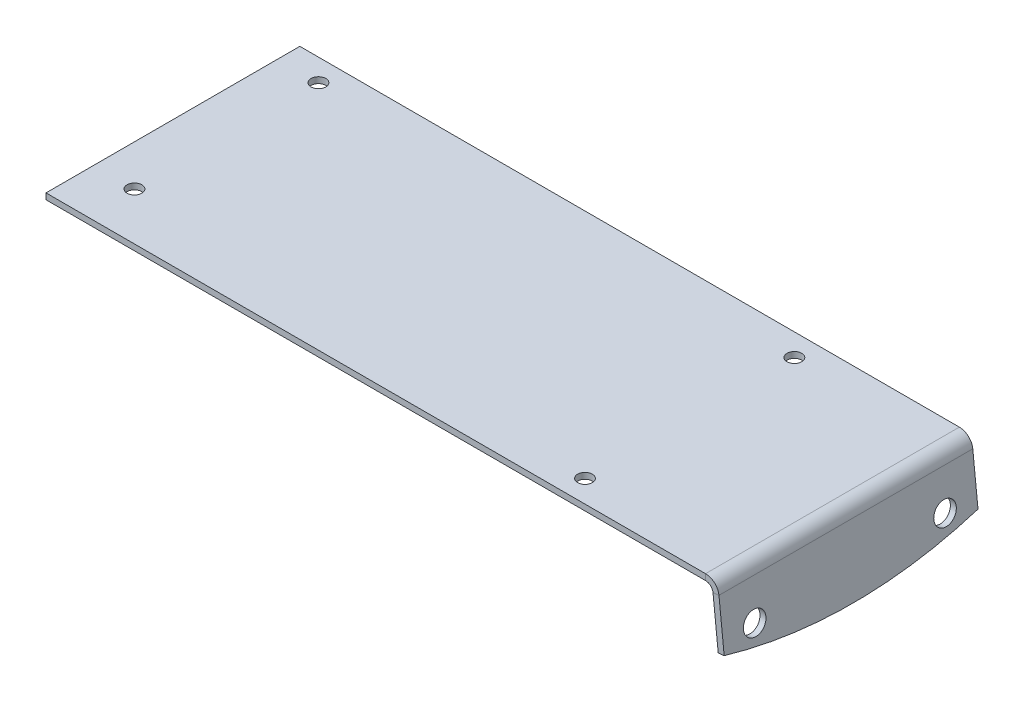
ISO-10303-21;
HEADER;
FILE_DESCRIPTION(('STEP AP214'),'2;1');
FILE_NAME('part.step','',(''),(''),'','','');
FILE_SCHEMA(('AUTOMOTIVE_DESIGN { 1 0 10303 214 1 1 1 1 }'));
ENDSEC;
DATA;
#1=APPLICATION_CONTEXT('core data for automotive mechanical design processes');
#2=APPLICATION_PROTOCOL_DEFINITION('international standard','automotive_design',2000,#1);
#3=PRODUCT_CONTEXT('',#1,'mechanical');
#4=PRODUCT('Part','Part','',(#3));
#5=PRODUCT_RELATED_PRODUCT_CATEGORY('part','',(#4));
#6=PRODUCT_DEFINITION_FORMATION('','',#4);
#7=PRODUCT_DEFINITION_CONTEXT('part definition',#1,'design');
#8=PRODUCT_DEFINITION('design','',#6,#7);
#9=PRODUCT_DEFINITION_SHAPE('','',#8);
#10=(LENGTH_UNIT() NAMED_UNIT(*) SI_UNIT(.MILLI.,.METRE.));
#11=(NAMED_UNIT(*) PLANE_ANGLE_UNIT() SI_UNIT($,.RADIAN.));
#12=(NAMED_UNIT(*) SI_UNIT($,.STERADIAN.) SOLID_ANGLE_UNIT());
#13=UNCERTAINTY_MEASURE_WITH_UNIT(LENGTH_MEASURE(1.E-05),#10,'distance_accuracy_value','');
#14=(GEOMETRIC_REPRESENTATION_CONTEXT(3) GLOBAL_UNCERTAINTY_ASSIGNED_CONTEXT((#13)) GLOBAL_UNIT_ASSIGNED_CONTEXT((#10,
#11,#12)) REPRESENTATION_CONTEXT('',''));
#15=CARTESIAN_POINT('',(0.,0.,0.));
#16=DIRECTION('',(0.,0.,1.));
#17=DIRECTION('',(1.,0.,0.));
#18=AXIS2_PLACEMENT_3D('',#15,#16,#17);
#19=CARTESIAN_POINT('',(136.517550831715,-18.657106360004,0.));
#20=DIRECTION('',(0.,0.,-1.));
#21=DIRECTION('',(-1.,0.,0.));
#22=AXIS2_PLACEMENT_3D('',#19,#20,#21);
#23=PLANE('',#22);
#24=DIRECTION('',(-0.994521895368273,-0.104528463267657,0.));
#25=VECTOR('',#24,1.);
#26=CARTESIAN_POINT('',(134.535130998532,-11.2757682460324,0.));
#27=LINE('',#26,#25);
#28=CARTESIAN_POINT('',(134.535130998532,-11.2757682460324,0.));
#29=VERTEX_POINT('',#28);
#30=CARTESIAN_POINT('',(135.728557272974,-11.1503340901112,0.));
#31=VERTEX_POINT('',#30);
#32=EDGE_CURVE('E50',#29,#31,#27,.F.);
#33=ORIENTED_EDGE('',*,*,#32,.T.);
#34=DIRECTION('',(0.104528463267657,-0.994521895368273,0.));
#35=VECTOR('',#34,1.);
#36=CARTESIAN_POINT('',(136.517550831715,-18.657106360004,0.));
#37=LINE('',#36,#35);
#38=CARTESIAN_POINT('',(134.684603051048,-1.21777314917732,0.));
#39=VERTEX_POINT('',#38);
#40=EDGE_CURVE('E116',#39,#31,#37,.T.);
#41=ORIENTED_EDGE('',*,*,#40,.F.);
#42=DIRECTION('',(0.994521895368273,0.104528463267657,0.));
#43=VECTOR('',#42,1.);
#44=CARTESIAN_POINT('',(133.491176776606,-1.34320730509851,0.));
#45=LINE('',#44,#43);
#46=CARTESIAN_POINT('',(133.491176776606,-1.34320730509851,0.));
#47=VERTEX_POINT('',#46);
#48=EDGE_CURVE('E208',#47,#39,#45,.T.);
#49=ORIENTED_EDGE('',*,*,#48,.F.);
#50=DIRECTION('',(0.104528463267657,-0.994521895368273,0.));
#51=VECTOR('',#50,1.);
#52=CARTESIAN_POINT('',(135.324124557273,-18.7825405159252,0.));
#53=LINE('',#52,#51);
#54=EDGE_CURVE('E130',#47,#29,#53,.T.);
#55=ORIENTED_EDGE('',*,*,#54,.T.);
#56=EDGE_LOOP('',(#33,#41,#49,#55));
#57=FACE_BOUND('',#56,.T.);
#58=ADVANCED_FACE('F33',(#57),#23,.F.);
#59=CARTESIAN_POINT('',(134.543426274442,0.12543415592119,-50.8));
#60=DIRECTION('',(0.,0.,1.));
#61=DIRECTION('',(1.,0.,0.));
#62=AXIS2_PLACEMENT_3D('',#59,#60,#61);
#63=PLANE('',#62);
#64=DIRECTION('',(-0.994521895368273,-0.104528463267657,0.));
#65=VECTOR('',#64,1.);
#66=CARTESIAN_POINT('',(134.535130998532,-11.2757682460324,-50.8));
#67=LINE('',#66,#65);
#68=CARTESIAN_POINT('',(134.535130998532,-11.2757682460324,-50.8));
#69=VERTEX_POINT('',#68);
#70=CARTESIAN_POINT('',(135.728557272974,-11.1503340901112,-50.8));
#71=VERTEX_POINT('',#70);
#72=EDGE_CURVE('E99',#69,#71,#67,.F.);
#73=ORIENTED_EDGE('',*,*,#72,.F.);
#74=DIRECTION('',(-0.104528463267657,0.994521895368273,0.));
#75=VECTOR('',#74,1.);
#76=CARTESIAN_POINT('',(133.35,0.,-50.8));
#77=LINE('',#76,#75);
#78=CARTESIAN_POINT('',(133.491176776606,-1.34320730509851,-50.8));
#79=VERTEX_POINT('',#78);
#80=EDGE_CURVE('E126',#69,#79,#77,.T.);
#81=ORIENTED_EDGE('',*,*,#80,.T.);
#82=DIRECTION('',(0.994521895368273,0.104528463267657,0.));
#83=VECTOR('',#82,1.);
#84=CARTESIAN_POINT('',(133.491176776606,-1.34320730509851,-50.8));
#85=LINE('',#84,#83);
#86=CARTESIAN_POINT('',(134.684603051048,-1.21777314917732,-50.8));
#87=VERTEX_POINT('',#86);
#88=EDGE_CURVE('E121',#79,#87,#85,.T.);
#89=ORIENTED_EDGE('',*,*,#88,.T.);
#90=DIRECTION('',(-0.104528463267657,0.994521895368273,0.));
#91=VECTOR('',#90,1.);
#92=CARTESIAN_POINT('',(134.543426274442,0.12543415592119,-50.8));
#93=LINE('',#92,#91);
#94=EDGE_CURVE('E113',#71,#87,#93,.T.);
#95=ORIENTED_EDGE('',*,*,#94,.F.);
#96=EDGE_LOOP('',(#73,#81,#89,#95));
#97=FACE_BOUND('',#96,.T.);
#98=ADVANCED_FACE('F119',(#97),#63,.F.);
#99=CARTESIAN_POINT('',(134.543426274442,0.12543415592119,0.));
#100=DIRECTION('',(-0.994521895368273,-0.104528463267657,0.));
#101=DIRECTION('',(0.104528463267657,-0.994521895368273,0.));
#102=AXIS2_PLACEMENT_3D('',#99,#100,#101);
#103=PLANE('',#102);
#104=CARTESIAN_POINT('',(135.481109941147,-8.79602999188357,-44.45));
#105=DIRECTION('',(0.994521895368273,0.104528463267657,0.));
#106=DIRECTION('',(-0.104528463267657,0.994521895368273,0.));
#107=AXIS2_PLACEMENT_3D('',#104,#105,#106);
#108=CIRCLE('',#107,2.2479);
#109=CARTESIAN_POINT('',(135.246140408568,-6.56044422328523,-44.45));
#110=VERTEX_POINT('',#109);
#111=EDGE_CURVE('E172',#110,#110,#108,.T.);
#112=ORIENTED_EDGE('',*,*,#111,.F.);
#113=EDGE_LOOP('',(#112));
#114=FACE_BOUND('',#113,.T.);
#115=CARTESIAN_POINT('',(135.481109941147,-8.79602999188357,-6.35));
#116=DIRECTION('',(0.994521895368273,0.104528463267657,0.));
#117=DIRECTION('',(-0.104528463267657,0.994521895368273,0.));
#118=AXIS2_PLACEMENT_3D('',#115,#116,#117);
#119=CIRCLE('',#118,2.2479);
#120=CARTESIAN_POINT('',(135.246140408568,-6.56044422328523,-6.35));
#121=VERTEX_POINT('',#120);
#122=EDGE_CURVE('E107',#121,#121,#119,.T.);
#123=ORIENTED_EDGE('',*,*,#122,.F.);
#124=EDGE_LOOP('',(#123));
#125=FACE_BOUND('',#124,.T.);
#126=CARTESIAN_POINT('',(126.132751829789,80.1476561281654,-25.4));
#127=DIRECTION('',(-0.994521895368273,-0.104528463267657,0.));
#128=DIRECTION('',(0.104528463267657,-0.994521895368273,0.));
#129=AXIS2_PLACEMENT_3D('',#126,#127,#128);
#130=CIRCLE('',#129,95.25);
#131=EDGE_CURVE('E102',#31,#71,#130,.F.);
#132=ORIENTED_EDGE('',*,*,#131,.T.);
#133=ORIENTED_EDGE('',*,*,#94,.T.);
#134=DIRECTION('',(0.,0.,-1.));
#135=VECTOR('',#134,1.);
#136=CARTESIAN_POINT('',(134.684603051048,-1.21777314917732,0.));
#137=LINE('',#136,#135);
#138=EDGE_CURVE('E133',#39,#87,#137,.T.);
#139=ORIENTED_EDGE('',*,*,#138,.F.);
#140=ORIENTED_EDGE('',*,*,#40,.T.);
#141=EDGE_LOOP('',(#132,#133,#139,#140));
#142=FACE_BOUND('',#141,.T.);
#143=ADVANCED_FACE('F111',(#114,#125,#142),#103,.F.);
#144=CARTESIAN_POINT('',(133.35,0.,0.));
#145=DIRECTION('',(-0.994521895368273,-0.104528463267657,0.));
#146=DIRECTION('',(0.104528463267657,-0.994521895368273,0.));
#147=AXIS2_PLACEMENT_3D('',#144,#145,#146);
#148=PLANE('',#147);
#149=CARTESIAN_POINT('',(134.287683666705,-8.92146414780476,-44.45));
#150=DIRECTION('',(-0.994521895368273,-0.104528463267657,0.));
#151=DIRECTION('',(0.104528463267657,-0.994521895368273,0.));
#152=AXIS2_PLACEMENT_3D('',#149,#150,#151);
#153=CIRCLE('',#152,2.2479);
#154=CARTESIAN_POINT('',(134.522653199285,-11.1570499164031,-44.45));
#155=VERTEX_POINT('',#154);
#156=EDGE_CURVE('E169',#155,#155,#153,.T.);
#157=ORIENTED_EDGE('',*,*,#156,.F.);
#158=EDGE_LOOP('',(#157));
#159=FACE_BOUND('',#158,.T.);
#160=CARTESIAN_POINT('',(134.287683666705,-8.92146414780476,-6.35));
#161=DIRECTION('',(-0.994521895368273,-0.104528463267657,0.));
#162=DIRECTION('',(0.104528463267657,-0.994521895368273,0.));
#163=AXIS2_PLACEMENT_3D('',#160,#161,#162);
#164=CIRCLE('',#163,2.2479);
#165=CARTESIAN_POINT('',(134.522653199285,-11.1570499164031,-6.35));
#166=VERTEX_POINT('',#165);
#167=EDGE_CURVE('E173',#166,#166,#164,.T.);
#168=ORIENTED_EDGE('',*,*,#167,.F.);
#169=EDGE_LOOP('',(#168));
#170=FACE_BOUND('',#169,.T.);
#171=ORIENTED_EDGE('',*,*,#80,.F.);
#172=CARTESIAN_POINT('',(124.939325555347,80.0222219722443,-25.4));
#173=DIRECTION('',(-0.994521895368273,-0.104528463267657,0.));
#174=DIRECTION('',(0.104528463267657,-0.994521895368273,0.));
#175=AXIS2_PLACEMENT_3D('',#172,#173,#174);
#176=CIRCLE('',#175,95.25);
#177=EDGE_CURVE('E103',#29,#69,#176,.F.);
#178=ORIENTED_EDGE('',*,*,#177,.F.);
#179=ORIENTED_EDGE('',*,*,#54,.F.);
#180=DIRECTION('',(0.,0.,1.));
#181=VECTOR('',#180,1.);
#182=CARTESIAN_POINT('',(133.491176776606,-1.34320730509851,-50.8));
#183=LINE('',#182,#181);
#184=EDGE_CURVE('E206',#79,#47,#183,.T.);
#185=ORIENTED_EDGE('',*,*,#184,.F.);
#186=EDGE_LOOP('',(#171,#178,#179,#185));
#187=FACE_BOUND('',#186,.T.);
#188=ADVANCED_FACE('F235',(#159,#170,#187),#148,.T.);
#189=CARTESIAN_POINT('',(0.,1.2,0.));
#190=DIRECTION('',(0.,0.,-1.));
#191=DIRECTION('',(-1.,0.,0.));
#192=AXIS2_PLACEMENT_3D('',#189,#190,#191);
#193=PLANE('',#192);
#194=DIRECTION('',(0.,1.,0.));
#195=VECTOR('',#194,1.);
#196=CARTESIAN_POINT('',(131.999393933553,0.,0.));
#197=LINE('',#196,#195);
#198=CARTESIAN_POINT('',(131.999393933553,0.,0.));
#199=VERTEX_POINT('',#198);
#200=CARTESIAN_POINT('',(131.999393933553,1.20000000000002,0.));
#201=VERTEX_POINT('',#200);
#202=EDGE_CURVE('E141',#199,#201,#197,.T.);
#203=ORIENTED_EDGE('',*,*,#202,.T.);
#204=DIRECTION('',(1.,0.,0.));
#205=VECTOR('',#204,1.);
#206=CARTESIAN_POINT('',(0.,1.2,0.));
#207=LINE('',#206,#205);
#208=CARTESIAN_POINT('',(0.,1.2,0.));
#209=VERTEX_POINT('',#208);
#210=EDGE_CURVE('E157',#209,#201,#207,.T.);
#211=ORIENTED_EDGE('',*,*,#210,.F.);
#212=DIRECTION('',(0.,-1.,0.));
#213=VECTOR('',#212,1.);
#214=CARTESIAN_POINT('',(0.,1.2,0.));
#215=LINE('',#214,#213);
#216=CARTESIAN_POINT('',(0.,0.,0.));
#217=VERTEX_POINT('',#216);
#218=EDGE_CURVE('E11',#209,#217,#215,.T.);
#219=ORIENTED_EDGE('',*,*,#218,.T.);
#220=DIRECTION('',(1.,0.,0.));
#221=VECTOR('',#220,1.);
#222=CARTESIAN_POINT('',(0.,0.,0.));
#223=LINE('',#222,#221);
#224=EDGE_CURVE('E164',#217,#199,#223,.T.);
#225=ORIENTED_EDGE('',*,*,#224,.T.);
#226=EDGE_LOOP('',(#203,#211,#219,#225));
#227=FACE_BOUND('',#226,.T.);
#228=ADVANCED_FACE('F237',(#227),#193,.F.);
#229=CARTESIAN_POINT('',(0.,1.2,-50.8));
#230=DIRECTION('',(0.,0.,1.));
#231=DIRECTION('',(1.,0.,0.));
#232=AXIS2_PLACEMENT_3D('',#229,#230,#231);
#233=PLANE('',#232);
#234=DIRECTION('',(0.,1.,0.));
#235=VECTOR('',#234,1.);
#236=CARTESIAN_POINT('',(131.999393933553,0.,-50.8));
#237=LINE('',#236,#235);
#238=CARTESIAN_POINT('',(131.999393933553,0.,-50.8));
#239=VERTEX_POINT('',#238);
#240=CARTESIAN_POINT('',(131.999393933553,1.2,-50.8));
#241=VERTEX_POINT('',#240);
#242=EDGE_CURVE('E148',#239,#241,#237,.T.);
#243=ORIENTED_EDGE('',*,*,#242,.F.);
#244=DIRECTION('',(-1.,0.,0.));
#245=VECTOR('',#244,1.);
#246=CARTESIAN_POINT('',(0.,0.,-50.8));
#247=LINE('',#246,#245);
#248=CARTESIAN_POINT('',(0.,0.,-50.8));
#249=VERTEX_POINT('',#248);
#250=EDGE_CURVE('E158',#239,#249,#247,.T.);
#251=ORIENTED_EDGE('',*,*,#250,.T.);
#252=DIRECTION('',(0.,-1.,0.));
#253=VECTOR('',#252,1.);
#254=CARTESIAN_POINT('',(0.,1.2,-50.8));
#255=LINE('',#254,#253);
#256=CARTESIAN_POINT('',(0.,1.2,-50.8));
#257=VERTEX_POINT('',#256);
#258=EDGE_CURVE('E42',#257,#249,#255,.T.);
#259=ORIENTED_EDGE('',*,*,#258,.F.);
#260=DIRECTION('',(-1.,0.,0.));
#261=VECTOR('',#260,1.);
#262=CARTESIAN_POINT('',(0.,1.2,-50.8));
#263=LINE('',#262,#261);
#264=EDGE_CURVE('E160',#241,#257,#263,.T.);
#265=ORIENTED_EDGE('',*,*,#264,.F.);
#266=EDGE_LOOP('',(#243,#251,#259,#265));
#267=FACE_BOUND('',#266,.T.);
#268=ADVANCED_FACE('F220',(#267),#233,.F.);
#269=CARTESIAN_POINT('',(0.,1.2,-50.8));
#270=DIRECTION('',(0.,-1.,0.));
#271=DIRECTION('',(0.,0.,-1.));
#272=AXIS2_PLACEMENT_3D('',#269,#270,#271);
#273=PLANE('',#272);
#274=CARTESIAN_POINT('',(103.424393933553,1.2,-46.355));
#275=DIRECTION('',(0.,1.,0.));
#276=DIRECTION('',(0.,0.,1.));
#277=AXIS2_PLACEMENT_3D('',#274,#275,#276);
#278=CIRCLE('',#277,1.47319999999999);
#279=CARTESIAN_POINT('',(103.424393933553,1.2,-44.8818));
#280=VERTEX_POINT('',#279);
#281=EDGE_CURVE('E193',#280,#280,#278,.T.);
#282=ORIENTED_EDGE('',*,*,#281,.F.);
#283=EDGE_LOOP('',(#282));
#284=FACE_BOUND('',#283,.T.);
#285=CARTESIAN_POINT('',(103.424393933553,1.2,-4.445));
#286=DIRECTION('',(0.,1.,0.));
#287=DIRECTION('',(0.,0.,1.));
#288=AXIS2_PLACEMENT_3D('',#285,#286,#287);
#289=CIRCLE('',#288,1.47319999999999);
#290=CARTESIAN_POINT('',(103.424393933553,1.2,-2.97180000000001));
#291=VERTEX_POINT('',#290);
#292=EDGE_CURVE('E182',#291,#291,#289,.T.);
#293=ORIENTED_EDGE('',*,*,#292,.F.);
#294=EDGE_LOOP('',(#293));
#295=FACE_BOUND('',#294,.T.);
#296=CARTESIAN_POINT('',(8.17439393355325,1.2,-9.52500000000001));
#297=DIRECTION('',(0.,1.,0.));
#298=DIRECTION('',(0.,0.,1.));
#299=AXIS2_PLACEMENT_3D('',#296,#297,#298);
#300=CIRCLE('',#299,1.4732);
#301=CARTESIAN_POINT('',(8.17439393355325,1.2,-8.05180000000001));
#302=VERTEX_POINT('',#301);
#303=EDGE_CURVE('E181',#302,#302,#300,.T.);
#304=ORIENTED_EDGE('',*,*,#303,.F.);
#305=EDGE_LOOP('',(#304));
#306=FACE_BOUND('',#305,.T.);
#307=CARTESIAN_POINT('',(8.17439393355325,1.2,-46.355));
#308=DIRECTION('',(0.,1.,0.));
#309=DIRECTION('',(0.,0.,1.));
#310=AXIS2_PLACEMENT_3D('',#307,#308,#309);
#311=CIRCLE('',#310,1.4732);
#312=CARTESIAN_POINT('',(8.17439393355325,1.2,-44.8818));
#313=VERTEX_POINT('',#312);
#314=EDGE_CURVE('E178',#313,#313,#311,.T.);
#315=ORIENTED_EDGE('',*,*,#314,.F.);
#316=EDGE_LOOP('',(#315));
#317=FACE_BOUND('',#316,.T.);
#318=DIRECTION('',(0.,0.,1.));
#319=VECTOR('',#318,1.);
#320=CARTESIAN_POINT('',(131.999393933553,1.20000000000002,0.));
#321=LINE('',#320,#319);
#322=EDGE_CURVE('E135',#201,#241,#321,.F.);
#323=ORIENTED_EDGE('',*,*,#322,.T.);
#324=ORIENTED_EDGE('',*,*,#264,.T.);
#325=DIRECTION('',(0.,0.,1.));
#326=VECTOR('',#325,1.);
#327=CARTESIAN_POINT('',(0.,1.2,0.));
#328=LINE('',#327,#326);
#329=EDGE_CURVE('E154',#257,#209,#328,.T.);
#330=ORIENTED_EDGE('',*,*,#329,.T.);
#331=ORIENTED_EDGE('',*,*,#210,.T.);
#332=EDGE_LOOP('',(#323,#324,#330,#331));
#333=FACE_BOUND('',#332,.T.);
#334=ADVANCED_FACE('F265',(#284,#295,#306,#317,#333),#273,.F.);
#335=CARTESIAN_POINT('',(0.,0.,-50.8));
#336=DIRECTION('',(0.,-1.,0.));
#337=DIRECTION('',(0.,0.,-1.));
#338=AXIS2_PLACEMENT_3D('',#335,#336,#337);
#339=PLANE('',#338);
#340=CARTESIAN_POINT('',(103.424393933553,0.,-46.355));
#341=DIRECTION('',(0.,-1.,0.));
#342=DIRECTION('',(0.,0.,-1.));
#343=AXIS2_PLACEMENT_3D('',#340,#341,#342);
#344=CIRCLE('',#343,1.47319999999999);
#345=CARTESIAN_POINT('',(103.424393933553,0.,-47.8282));
#346=VERTEX_POINT('',#345);
#347=EDGE_CURVE('E37',#346,#346,#344,.T.);
#348=ORIENTED_EDGE('',*,*,#347,.F.);
#349=EDGE_LOOP('',(#348));
#350=FACE_BOUND('',#349,.T.);
#351=CARTESIAN_POINT('',(103.424393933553,0.,-4.445));
#352=DIRECTION('',(0.,-1.,0.));
#353=DIRECTION('',(0.,0.,-1.));
#354=AXIS2_PLACEMENT_3D('',#351,#352,#353);
#355=CIRCLE('',#354,1.47319999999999);
#356=CARTESIAN_POINT('',(103.424393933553,0.,-5.9182));
#357=VERTEX_POINT('',#356);
#358=EDGE_CURVE('E179',#357,#357,#355,.T.);
#359=ORIENTED_EDGE('',*,*,#358,.F.);
#360=EDGE_LOOP('',(#359));
#361=FACE_BOUND('',#360,.T.);
#362=CARTESIAN_POINT('',(8.17439393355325,0.,-9.52500000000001));
#363=DIRECTION('',(0.,-1.,0.));
#364=DIRECTION('',(0.,0.,-1.));
#365=AXIS2_PLACEMENT_3D('',#362,#363,#364);
#366=CIRCLE('',#365,1.4732);
#367=CARTESIAN_POINT('',(8.17439393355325,0.,-10.9982));
#368=VERTEX_POINT('',#367);
#369=EDGE_CURVE('E186',#368,#368,#366,.T.);
#370=ORIENTED_EDGE('',*,*,#369,.F.);
#371=EDGE_LOOP('',(#370));
#372=FACE_BOUND('',#371,.T.);
#373=CARTESIAN_POINT('',(8.17439393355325,0.,-46.355));
#374=DIRECTION('',(0.,-1.,0.));
#375=DIRECTION('',(0.,0.,-1.));
#376=AXIS2_PLACEMENT_3D('',#373,#374,#375);
#377=CIRCLE('',#376,1.4732);
#378=CARTESIAN_POINT('',(8.17439393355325,0.,-47.8282));
#379=VERTEX_POINT('',#378);
#380=EDGE_CURVE('E176',#379,#379,#377,.T.);
#381=ORIENTED_EDGE('',*,*,#380,.F.);
#382=EDGE_LOOP('',(#381));
#383=FACE_BOUND('',#382,.T.);
#384=ORIENTED_EDGE('',*,*,#250,.F.);
#385=DIRECTION('',(0.,0.,1.));
#386=VECTOR('',#385,1.);
#387=CARTESIAN_POINT('',(131.999393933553,0.,0.));
#388=LINE('',#387,#386);
#389=EDGE_CURVE('E58',#199,#239,#388,.F.);
#390=ORIENTED_EDGE('',*,*,#389,.F.);
#391=ORIENTED_EDGE('',*,*,#224,.F.);
#392=DIRECTION('',(0.,0.,1.));
#393=VECTOR('',#392,1.);
#394=CARTESIAN_POINT('',(0.,0.,0.));
#395=LINE('',#394,#393);
#396=EDGE_CURVE('E151',#249,#217,#395,.T.);
#397=ORIENTED_EDGE('',*,*,#396,.F.);
#398=EDGE_LOOP('',(#384,#390,#391,#397));
#399=FACE_BOUND('',#398,.T.);
#400=ADVANCED_FACE('F223',(#350,#361,#372,#383,#399),#339,.T.);
#401=CARTESIAN_POINT('',(0.,1.2,0.));
#402=DIRECTION('',(1.,0.,0.));
#403=DIRECTION('',(0.,0.,-1.));
#404=AXIS2_PLACEMENT_3D('',#401,#402,#403);
#405=PLANE('',#404);
#406=ORIENTED_EDGE('',*,*,#396,.T.);
#407=ORIENTED_EDGE('',*,*,#218,.F.);
#408=ORIENTED_EDGE('',*,*,#329,.F.);
#409=ORIENTED_EDGE('',*,*,#258,.T.);
#410=EDGE_LOOP('',(#406,#407,#408,#409));
#411=FACE_BOUND('',#410,.T.);
#412=ADVANCED_FACE('F35',(#411),#405,.F.);
#413=CARTESIAN_POINT('',(131.999393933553,-1.5,-50.8));
#414=DIRECTION('',(0.,0.,-1.));
#415=DIRECTION('',(-1.,0.,0.));
#416=AXIS2_PLACEMENT_3D('',#413,#414,#415);
#417=PLANE('',#416);
#418=ORIENTED_EDGE('',*,*,#88,.F.);
#419=CARTESIAN_POINT('',(131.999393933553,-1.5,-50.8));
#420=DIRECTION('',(0.,0.,1.));
#421=DIRECTION('',(1.,0.,0.));
#422=AXIS2_PLACEMENT_3D('',#419,#420,#421);
#423=CIRCLE('',#422,1.50000000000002);
#424=EDGE_CURVE('E144',#239,#79,#423,.F.);
#425=ORIENTED_EDGE('',*,*,#424,.F.);
#426=ORIENTED_EDGE('',*,*,#242,.T.);
#427=CARTESIAN_POINT('',(131.999393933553,-1.5,-50.8));
#428=DIRECTION('',(0.,0.,1.));
#429=DIRECTION('',(1.,0.,0.));
#430=AXIS2_PLACEMENT_3D('',#427,#428,#429);
#431=CIRCLE('',#430,2.70000000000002);
#432=EDGE_CURVE('E137',#241,#87,#431,.F.);
#433=ORIENTED_EDGE('',*,*,#432,.T.);
#434=EDGE_LOOP('',(#418,#425,#426,#433));
#435=FACE_BOUND('',#434,.T.);
#436=ADVANCED_FACE('F216',(#435),#417,.T.);
#437=CARTESIAN_POINT('',(131.999393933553,-1.5,0.));
#438=DIRECTION('',(0.,0.,-1.));
#439=DIRECTION('',(-1.,0.,0.));
#440=AXIS2_PLACEMENT_3D('',#437,#438,#439);
#441=PLANE('',#440);
#442=CARTESIAN_POINT('',(131.999393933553,-1.5,0.));
#443=DIRECTION('',(0.,0.,1.));
#444=DIRECTION('',(1.,0.,0.));
#445=AXIS2_PLACEMENT_3D('',#442,#443,#444);
#446=CIRCLE('',#445,1.50000000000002);
#447=EDGE_CURVE('E122',#47,#199,#446,.T.);
#448=ORIENTED_EDGE('',*,*,#447,.F.);
#449=ORIENTED_EDGE('',*,*,#48,.T.);
#450=CARTESIAN_POINT('',(131.999393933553,-1.5,0.));
#451=DIRECTION('',(0.,0.,1.));
#452=DIRECTION('',(1.,0.,0.));
#453=AXIS2_PLACEMENT_3D('',#450,#451,#452);
#454=CIRCLE('',#453,2.70000000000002);
#455=EDGE_CURVE('E138',#39,#201,#454,.T.);
#456=ORIENTED_EDGE('',*,*,#455,.T.);
#457=ORIENTED_EDGE('',*,*,#202,.F.);
#458=EDGE_LOOP('',(#448,#449,#456,#457));
#459=FACE_BOUND('',#458,.T.);
#460=ADVANCED_FACE('F231',(#459),#441,.F.);
#461=CARTESIAN_POINT('',(131.999393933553,-1.5,0.));
#462=DIRECTION('',(0.,0.,1.));
#463=DIRECTION('',(0.994521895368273,0.104528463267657,0.));
#464=AXIS2_PLACEMENT_3D('',#461,#462,#463);
#465=CYLINDRICAL_SURFACE('',#464,2.70000000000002);
#466=ORIENTED_EDGE('',*,*,#322,.F.);
#467=ORIENTED_EDGE('',*,*,#455,.F.);
#468=ORIENTED_EDGE('',*,*,#138,.T.);
#469=ORIENTED_EDGE('',*,*,#432,.F.);
#470=EDGE_LOOP('',(#466,#467,#468,#469));
#471=FACE_BOUND('',#470,.T.);
#472=ADVANCED_FACE('F214',(#471),#465,.T.);
#473=CARTESIAN_POINT('',(131.999393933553,-1.5,0.));
#474=DIRECTION('',(0.,0.,1.));
#475=DIRECTION('',(0.994521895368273,0.104528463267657,0.));
#476=AXIS2_PLACEMENT_3D('',#473,#474,#475);
#477=CYLINDRICAL_SURFACE('',#476,1.50000000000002);
#478=ORIENTED_EDGE('',*,*,#389,.T.);
#479=ORIENTED_EDGE('',*,*,#424,.T.);
#480=ORIENTED_EDGE('',*,*,#184,.T.);
#481=ORIENTED_EDGE('',*,*,#447,.T.);
#482=EDGE_LOOP('',(#478,#479,#480,#481));
#483=FACE_BOUND('',#482,.T.);
#484=ADVANCED_FACE('F225',(#483),#477,.F.);
#485=CARTESIAN_POINT('',(135.481109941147,-8.79602999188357,-44.45));
#486=DIRECTION('',(0.994521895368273,0.104528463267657,0.));
#487=DIRECTION('',(-0.104528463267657,0.994521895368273,0.));
#488=AXIS2_PLACEMENT_3D('',#485,#486,#487);
#489=CYLINDRICAL_SURFACE('',#488,2.2479);
#490=ORIENTED_EDGE('',*,*,#156,.T.);
#491=EDGE_LOOP('',(#490));
#492=FACE_BOUND('',#491,.T.);
#493=ORIENTED_EDGE('',*,*,#111,.T.);
#494=EDGE_LOOP('',(#493));
#495=FACE_BOUND('',#494,.T.);
#496=ADVANCED_FACE('F260',(#492,#495),#489,.F.);
#497=CARTESIAN_POINT('',(135.481109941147,-8.79602999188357,-6.35));
#498=DIRECTION('',(0.994521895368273,0.104528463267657,0.));
#499=DIRECTION('',(-0.104528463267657,0.994521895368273,0.));
#500=AXIS2_PLACEMENT_3D('',#497,#498,#499);
#501=CYLINDRICAL_SURFACE('',#500,2.2479);
#502=ORIENTED_EDGE('',*,*,#167,.T.);
#503=EDGE_LOOP('',(#502));
#504=FACE_BOUND('',#503,.T.);
#505=ORIENTED_EDGE('',*,*,#122,.T.);
#506=EDGE_LOOP('',(#505));
#507=FACE_BOUND('',#506,.T.);
#508=ADVANCED_FACE('F315',(#504,#507),#501,.F.);
#509=CARTESIAN_POINT('',(124.939325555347,80.0222219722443,-25.4));
#510=DIRECTION('',(-0.994521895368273,-0.104528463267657,0.));
#511=DIRECTION('',(0.104528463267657,-0.994521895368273,0.));
#512=AXIS2_PLACEMENT_3D('',#509,#510,#511);
#513=CYLINDRICAL_SURFACE('',#512,95.25);
#514=ORIENTED_EDGE('',*,*,#177,.T.);
#515=ORIENTED_EDGE('',*,*,#72,.T.);
#516=ORIENTED_EDGE('',*,*,#131,.F.);
#517=ORIENTED_EDGE('',*,*,#32,.F.);
#518=EDGE_LOOP('',(#514,#515,#516,#517));
#519=FACE_BOUND('',#518,.T.);
#520=ADVANCED_FACE('F101',(#519),#513,.T.);
#521=CARTESIAN_POINT('',(8.17439393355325,1.2,-46.355));
#522=DIRECTION('',(0.,1.,0.));
#523=DIRECTION('',(0.,0.,1.));
#524=AXIS2_PLACEMENT_3D('',#521,#522,#523);
#525=CYLINDRICAL_SURFACE('',#524,1.4732);
#526=ORIENTED_EDGE('',*,*,#380,.T.);
#527=EDGE_LOOP('',(#526));
#528=FACE_BOUND('',#527,.T.);
#529=ORIENTED_EDGE('',*,*,#314,.T.);
#530=EDGE_LOOP('',(#529));
#531=FACE_BOUND('',#530,.T.);
#532=ADVANCED_FACE('F329',(#528,#531),#525,.F.);
#533=CARTESIAN_POINT('',(8.17439393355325,1.2,-9.52500000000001));
#534=DIRECTION('',(0.,1.,0.));
#535=DIRECTION('',(0.,0.,1.));
#536=AXIS2_PLACEMENT_3D('',#533,#534,#535);
#537=CYLINDRICAL_SURFACE('',#536,1.4732);
#538=ORIENTED_EDGE('',*,*,#369,.T.);
#539=EDGE_LOOP('',(#538));
#540=FACE_BOUND('',#539,.T.);
#541=ORIENTED_EDGE('',*,*,#303,.T.);
#542=EDGE_LOOP('',(#541));
#543=FACE_BOUND('',#542,.T.);
#544=ADVANCED_FACE('F335',(#540,#543),#537,.F.);
#545=CARTESIAN_POINT('',(103.424393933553,1.2,-4.445));
#546=DIRECTION('',(0.,1.,0.));
#547=DIRECTION('',(0.,0.,1.));
#548=AXIS2_PLACEMENT_3D('',#545,#546,#547);
#549=CYLINDRICAL_SURFACE('',#548,1.47319999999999);
#550=ORIENTED_EDGE('',*,*,#358,.T.);
#551=EDGE_LOOP('',(#550));
#552=FACE_BOUND('',#551,.T.);
#553=ORIENTED_EDGE('',*,*,#292,.T.);
#554=EDGE_LOOP('',(#553));
#555=FACE_BOUND('',#554,.T.);
#556=ADVANCED_FACE('F343',(#552,#555),#549,.F.);
#557=CARTESIAN_POINT('',(103.424393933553,1.2,-46.355));
#558=DIRECTION('',(0.,1.,0.));
#559=DIRECTION('',(0.,0.,1.));
#560=AXIS2_PLACEMENT_3D('',#557,#558,#559);
#561=CYLINDRICAL_SURFACE('',#560,1.47319999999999);
#562=ORIENTED_EDGE('',*,*,#347,.T.);
#563=EDGE_LOOP('',(#562));
#564=FACE_BOUND('',#563,.T.);
#565=ORIENTED_EDGE('',*,*,#281,.T.);
#566=EDGE_LOOP('',(#565));
#567=FACE_BOUND('',#566,.T.);
#568=ADVANCED_FACE('F351',(#564,#567),#561,.F.);
#569=CLOSED_SHELL('',(#58,#98,#143,#188,#228,#268,#334,#400,#412,#436,#460,#472,#484,#496,#508,
#520,#532,#544,#556,#568));
#570=MANIFOLD_SOLID_BREP('B2',#569);
#571=ADVANCED_BREP_SHAPE_REPRESENTATION('',(#18,#570),#14);
#572=SHAPE_DEFINITION_REPRESENTATION(#9,#571);
ENDSEC;
END-ISO-10303-21;
